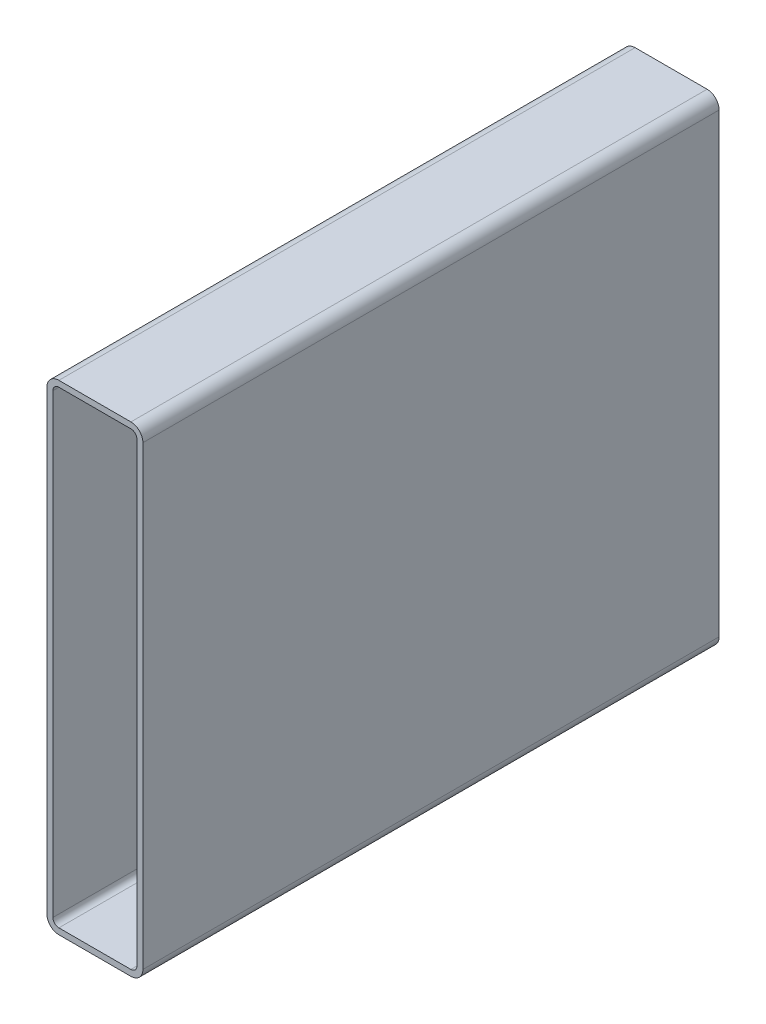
from build123d import *

# Parameters (mm, degrees)
BOSS_EXTRUDE1_DEPTH = 304.8


with BuildPart() as part:
    # Sketch1 → Boss-Extrude1 (new body)
    with BuildSketch(Plane.XY):
        with BuildLine():
            Line((6.35, 254), (44.45, 254))
            ThreePointArc((44.45, 254), (48.940128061, 252.140128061), (50.8, 247.65))
            Line((50.8, 247.65), (50.8, 6.35))
            ThreePointArc((50.8, 6.35), (48.940128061, 1.859871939), (44.45, 0))
            Line((44.45, 0), (6.35, 0))
            ThreePointArc((6.35, 0), (1.859871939, 1.859871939), (0, 6.35))
            Line((0, 6.35), (0, 247.65))
            ThreePointArc((0, 247.65), (1.859871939, 252.140128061), (6.35, 254))
        make_face()
        with BuildLine():
            Line((6.35, 250.825), (44.45, 250.825))
            ThreePointArc((44.45, 250.825), (46.69506403, 249.89506403), (47.625, 247.65))
            Line((47.625, 247.65), (47.625, 6.35))
            ThreePointArc((47.625, 6.35), (46.69506403, 4.10493597), (44.45, 3.175))
            Line((44.45, 3.175), (6.35, 3.175))
            ThreePointArc((6.35, 3.175), (4.10493597, 4.10493597), (3.175, 6.35))
            Line((3.175, 6.35), (3.175, 247.65))
            ThreePointArc((3.175, 247.65), (4.10493597, 249.89506403), (6.35, 250.825))
        make_face(mode=Mode.SUBTRACT)
    extrude(amount=BOSS_EXTRUDE1_DEPTH)


solid = part.part
